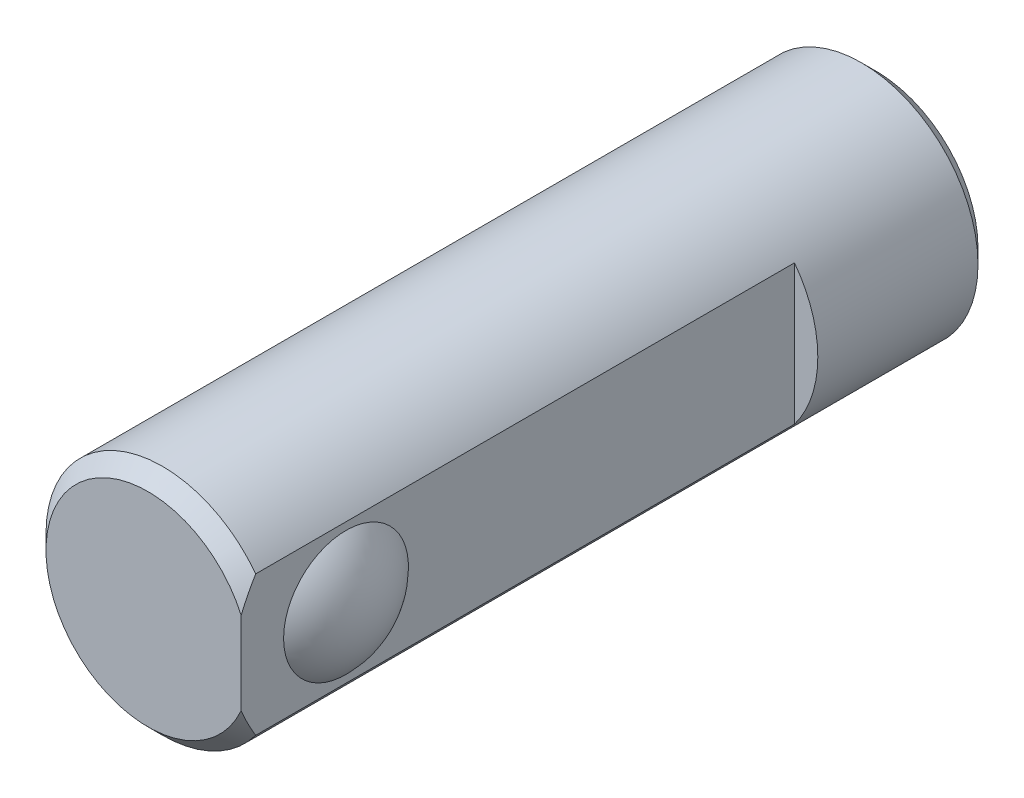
ISO-10303-21;
HEADER;
FILE_DESCRIPTION(('STEP AP214'),'2;1');
FILE_NAME('part.step','',(''),(''),'','','');
FILE_SCHEMA(('AUTOMOTIVE_DESIGN { 1 0 10303 214 1 1 1 1 }'));
ENDSEC;
DATA;
#1=APPLICATION_CONTEXT('core data for automotive mechanical design processes');
#2=APPLICATION_PROTOCOL_DEFINITION('international standard','automotive_design',2000,#1);
#3=PRODUCT_CONTEXT('',#1,'mechanical');
#4=PRODUCT('Part','Part','',(#3));
#5=PRODUCT_RELATED_PRODUCT_CATEGORY('part','',(#4));
#6=PRODUCT_DEFINITION_FORMATION('','',#4);
#7=PRODUCT_DEFINITION_CONTEXT('part definition',#1,'design');
#8=PRODUCT_DEFINITION('design','',#6,#7);
#9=PRODUCT_DEFINITION_SHAPE('','',#8);
#10=(LENGTH_UNIT() NAMED_UNIT(*) SI_UNIT(.MILLI.,.METRE.));
#11=(NAMED_UNIT(*) PLANE_ANGLE_UNIT() SI_UNIT($,.RADIAN.));
#12=(NAMED_UNIT(*) SI_UNIT($,.STERADIAN.) SOLID_ANGLE_UNIT());
#13=UNCERTAINTY_MEASURE_WITH_UNIT(LENGTH_MEASURE(1.E-05),#10,'distance_accuracy_value','');
#14=(GEOMETRIC_REPRESENTATION_CONTEXT(3) GLOBAL_UNCERTAINTY_ASSIGNED_CONTEXT((#13)) GLOBAL_UNIT_ASSIGNED_CONTEXT((#10,
#11,#12)) REPRESENTATION_CONTEXT('',''));
#15=CARTESIAN_POINT('',(0.,0.,0.));
#16=DIRECTION('',(0.,0.,1.));
#17=DIRECTION('',(1.,0.,0.));
#18=AXIS2_PLACEMENT_3D('',#15,#16,#17);
#19=CARTESIAN_POINT('',(3.2,2.4,6.));
#20=DIRECTION('',(-1.,0.,0.));
#21=DIRECTION('',(0.,0.,1.));
#22=AXIS2_PLACEMENT_3D('',#19,#20,#21);
#23=PLANE('',#22);
#24=DIRECTION('',(0.,-1.,0.));
#25=VECTOR('',#24,1.);
#26=CARTESIAN_POINT('',(3.2,2.4,25.));
#27=LINE('',#26,#25);
#28=CARTESIAN_POINT('',(3.2,1.41774468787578,25.));
#29=VERTEX_POINT('',#28);
#30=CARTESIAN_POINT('',(3.2,-1.41774468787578,25.));
#31=VERTEX_POINT('',#30);
#32=EDGE_CURVE('E54',#29,#31,#27,.T.);
#33=ORIENTED_EDGE('',*,*,#32,.T.);
#34=CARTESIAN_POINT('',(3.2,-1.41774468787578,25.));
#35=CARTESIAN_POINT('',(3.2,-1.5030503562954,24.9654302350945));
#36=CARTESIAN_POINT('',(3.2,-1.58742955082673,24.9286585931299));
#37=CARTESIAN_POINT('',(3.2,-1.75432885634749,24.8514141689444));
#38=CARTESIAN_POINT('',(3.2,-1.83685155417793,24.8109469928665));
#39=CARTESIAN_POINT('',(3.2,-2.00025969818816,24.7269204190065));
#40=CARTESIAN_POINT('',(3.2,-2.08114565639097,24.6833620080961));
#41=CARTESIAN_POINT('',(3.2,-2.24157538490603,24.5935610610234));
#42=CARTESIAN_POINT('',(3.2,-2.3211169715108,24.5473146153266));
#43=CARTESIAN_POINT('',(3.2,-2.4,24.5));
#44=B_SPLINE_CURVE_WITH_KNOTS('',3,(#34,#35,#36,#37,#38,#39,#40,#41,#42,#43),.UNSPECIFIED.,.F.,
.F.,(4,2,2,2,4),(0.,0.276056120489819,0.551700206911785,0.827256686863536,1.1032244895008),.UNSPECIFIED.);
#45=CARTESIAN_POINT('',(3.2,-2.4,24.5));
#46=VERTEX_POINT('',#45);
#47=EDGE_CURVE('E37',#31,#46,#44,.T.);
#48=ORIENTED_EDGE('',*,*,#47,.T.);
#49=DIRECTION('',(0.,0.,1.));
#50=VECTOR('',#49,1.);
#51=CARTESIAN_POINT('',(3.2,-2.4,6.));
#52=LINE('',#51,#50);
#53=CARTESIAN_POINT('',(3.2,-2.4,6.));
#54=VERTEX_POINT('',#53);
#55=EDGE_CURVE('E59',#54,#46,#52,.T.);
#56=ORIENTED_EDGE('',*,*,#55,.F.);
#57=DIRECTION('',(0.,-1.,0.));
#58=VECTOR('',#57,1.);
#59=CARTESIAN_POINT('',(3.2,2.4,6.));
#60=LINE('',#59,#58);
#61=CARTESIAN_POINT('',(3.2,2.4,6.));
#62=VERTEX_POINT('',#61);
#63=EDGE_CURVE('E53',#62,#54,#60,.T.);
#64=ORIENTED_EDGE('',*,*,#63,.F.);
#65=DIRECTION('',(0.,0.,1.));
#66=VECTOR('',#65,1.);
#67=CARTESIAN_POINT('',(3.2,2.4,6.));
#68=LINE('',#67,#66);
#69=CARTESIAN_POINT('',(3.2,2.4,24.5));
#70=VERTEX_POINT('',#69);
#71=EDGE_CURVE('E57',#62,#70,#68,.T.);
#72=ORIENTED_EDGE('',*,*,#71,.T.);
#73=CARTESIAN_POINT('',(3.2,2.4,24.5));
#74=CARTESIAN_POINT('',(3.2,2.3211169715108,24.5473146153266));
#75=CARTESIAN_POINT('',(3.2,2.24157538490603,24.5935610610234));
#76=CARTESIAN_POINT('',(3.2,2.08114565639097,24.6833620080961));
#77=CARTESIAN_POINT('',(3.2,2.00025969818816,24.7269204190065));
#78=CARTESIAN_POINT('',(3.2,1.83685155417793,24.8109469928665));
#79=CARTESIAN_POINT('',(3.2,1.75432885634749,24.8514141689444));
#80=CARTESIAN_POINT('',(3.2,1.58742955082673,24.9286585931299));
#81=CARTESIAN_POINT('',(3.2,1.5030503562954,24.9654302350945));
#82=CARTESIAN_POINT('',(3.2,1.41774468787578,25.));
#83=B_SPLINE_CURVE_WITH_KNOTS('',3,(#73,#74,#75,#76,#77,#78,#79,#80,#81,#82),.UNSPECIFIED.,.F.,
.F.,(4,2,2,2,4),(0.,0.275967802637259,0.551524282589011,0.827168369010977,1.1032244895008),.UNSPECIFIED.);
#84=EDGE_CURVE('E67',#70,#29,#83,.T.);
#85=ORIENTED_EDGE('',*,*,#84,.T.);
#86=EDGE_LOOP('',(#33,#48,#56,#64,#72,#85));
#87=FACE_BOUND('',#86,.T.);
#88=CARTESIAN_POINT('',(3.2,0.,21.4));
#89=DIRECTION('',(-1.,0.,0.));
#90=DIRECTION('',(0.,0.,1.));
#91=AXIS2_PLACEMENT_3D('',#88,#89,#90);
#92=CIRCLE('',#91,2.14242852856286);
#93=CARTESIAN_POINT('',(3.2,0.,23.5424285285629));
#94=VERTEX_POINT('',#93);
#95=EDGE_CURVE('E9',#94,#94,#92,.F.);
#96=ORIENTED_EDGE('',*,*,#95,.F.);
#97=EDGE_LOOP('',(#96));
#98=FACE_BOUND('',#97,.T.);
#99=ADVANCED_FACE('F14',(#87,#98),#23,.F.);
#100=CARTESIAN_POINT('',(0.,0.,0.));
#101=DIRECTION('',(0.,0.,1.));
#102=DIRECTION('',(1.,0.,0.));
#103=AXIS2_PLACEMENT_3D('',#100,#101,#102);
#104=CYLINDRICAL_SURFACE('',#103,4.);
#105=CARTESIAN_POINT('',(0.,0.,0.5));
#106=DIRECTION('',(0.,0.,1.));
#107=DIRECTION('',(1.,0.,0.));
#108=AXIS2_PLACEMENT_3D('',#105,#106,#107);
#109=CIRCLE('',#108,4.);
#110=CARTESIAN_POINT('',(4.,0.,0.5));
#111=VERTEX_POINT('',#110);
#112=EDGE_CURVE('E102',#111,#111,#109,.T.);
#113=ORIENTED_EDGE('',*,*,#112,.T.);
#114=EDGE_LOOP('',(#113));
#115=FACE_BOUND('',#114,.T.);
#116=ORIENTED_EDGE('',*,*,#55,.T.);
#117=CARTESIAN_POINT('',(0.,0.,24.5));
#118=DIRECTION('',(0.,0.,1.));
#119=DIRECTION('',(1.,0.,0.));
#120=AXIS2_PLACEMENT_3D('',#117,#118,#119);
#121=CIRCLE('',#120,4.);
#122=EDGE_CURVE('E29',#46,#70,#121,.F.);
#123=ORIENTED_EDGE('',*,*,#122,.T.);
#124=ORIENTED_EDGE('',*,*,#71,.F.);
#125=CARTESIAN_POINT('',(0.,0.,6.));
#126=DIRECTION('',(0.,0.,1.));
#127=DIRECTION('',(1.,0.,0.));
#128=AXIS2_PLACEMENT_3D('',#125,#126,#127);
#129=CIRCLE('',#128,4.);
#130=EDGE_CURVE('E50',#54,#62,#129,.T.);
#131=ORIENTED_EDGE('',*,*,#130,.F.);
#132=EDGE_LOOP('',(#116,#123,#124,#131));
#133=FACE_BOUND('',#132,.T.);
#134=ADVANCED_FACE('F16',(#115,#133),#104,.T.);
#135=CARTESIAN_POINT('',(0.,0.,0.));
#136=DIRECTION('',(0.,0.,1.));
#137=DIRECTION('',(1.,0.,0.));
#138=AXIS2_PLACEMENT_3D('',#135,#136,#137);
#139=PLANE('',#138);
#140=CARTESIAN_POINT('',(0.,0.,0.));
#141=DIRECTION('',(0.,0.,1.));
#142=DIRECTION('',(1.,0.,0.));
#143=AXIS2_PLACEMENT_3D('',#140,#141,#142);
#144=CIRCLE('',#143,3.5);
#145=CARTESIAN_POINT('',(3.5,0.,0.));
#146=VERTEX_POINT('',#145);
#147=EDGE_CURVE('E22',#146,#146,#144,.F.);
#148=ORIENTED_EDGE('',*,*,#147,.T.);
#149=EDGE_LOOP('',(#148));
#150=FACE_BOUND('',#149,.T.);
#151=ADVANCED_FACE('F90',(#150),#139,.F.);
#152=CARTESIAN_POINT('',(0.,0.,25.));
#153=DIRECTION('',(0.,0.,1.));
#154=DIRECTION('',(1.,0.,0.));
#155=AXIS2_PLACEMENT_3D('',#152,#153,#154);
#156=PLANE('',#155);
#157=ORIENTED_EDGE('',*,*,#32,.F.);
#158=CARTESIAN_POINT('',(0.,0.,25.));
#159=DIRECTION('',(0.,0.,1.));
#160=DIRECTION('',(1.,0.,0.));
#161=AXIS2_PLACEMENT_3D('',#158,#159,#160);
#162=CIRCLE('',#161,3.5);
#163=EDGE_CURVE('E62',#29,#31,#162,.T.);
#164=ORIENTED_EDGE('',*,*,#163,.T.);
#165=EDGE_LOOP('',(#157,#164));
#166=FACE_BOUND('',#165,.T.);
#167=ADVANCED_FACE('F87',(#166),#156,.T.);
#168=CARTESIAN_POINT('',(0.,0.,6.));
#169=DIRECTION('',(0.,0.,1.));
#170=DIRECTION('',(1.,0.,0.));
#171=AXIS2_PLACEMENT_3D('',#168,#169,#170);
#172=PLANE('',#171);
#173=ORIENTED_EDGE('',*,*,#130,.T.);
#174=ORIENTED_EDGE('',*,*,#63,.T.);
#175=EDGE_LOOP('',(#173,#174));
#176=FACE_BOUND('',#175,.T.);
#177=ADVANCED_FACE('F52',(#176),#172,.T.);
#178=CARTESIAN_POINT('',(0.,0.,25.));
#179=DIRECTION('',(0.,0.,-1.));
#180=DIRECTION('',(-1.,0.,0.));
#181=AXIS2_PLACEMENT_3D('',#178,#179,#180);
#182=CONICAL_SURFACE('',#181,3.5,0.785398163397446);
#183=ORIENTED_EDGE('',*,*,#84,.F.);
#184=ORIENTED_EDGE('',*,*,#122,.F.);
#185=ORIENTED_EDGE('',*,*,#47,.F.);
#186=ORIENTED_EDGE('',*,*,#163,.F.);
#187=EDGE_LOOP('',(#183,#184,#185,#186));
#188=FACE_BOUND('',#187,.T.);
#189=ADVANCED_FACE('F80',(#188),#182,.T.);
#190=CARTESIAN_POINT('',(0.,0.,0.5));
#191=DIRECTION('',(0.,0.,1.));
#192=DIRECTION('',(1.,0.,0.));
#193=AXIS2_PLACEMENT_3D('',#190,#191,#192);
#194=CONICAL_SURFACE('',#193,4.,0.785398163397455);
#195=ORIENTED_EDGE('',*,*,#147,.F.);
#196=EDGE_LOOP('',(#195));
#197=FACE_BOUND('',#196,.T.);
#198=ORIENTED_EDGE('',*,*,#112,.F.);
#199=EDGE_LOOP('',(#198));
#200=FACE_BOUND('',#199,.T.);
#201=ADVANCED_FACE('F107',(#197,#200),#194,.T.);
#202=CARTESIAN_POINT('',(1.09999999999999,0.,21.4));
#203=DIRECTION('',(0.,0.,-1.));
#204=DIRECTION('',(0.,1.,0.));
#205=AXIS2_PLACEMENT_3D('',#202,#203,#204);
#206=SPHERICAL_SURFACE('',#205,3.);
#207=CARTESIAN_POINT('',(1.09999999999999,0.,21.4));
#208=DIRECTION('',(-1.,0.,0.));
#209=DIRECTION('',(0.,0.,1.));
#210=AXIS2_PLACEMENT_3D('',#207,#208,#209);
#211=SPHERICAL_SURFACE('',#210,3.);
#212=ORIENTED_EDGE('',*,*,#95,.T.);
#213=EDGE_LOOP('',(#212));
#214=FACE_BOUND('',#213,.T.);
#215=ADVANCED_FACE('F109',(#214),#211,.T.);
#216=CLOSED_SHELL('',(#99,#134,#151,#167,#177,#189,#201,#215));
#217=MANIFOLD_SOLID_BREP('B1',#216);
#218=ADVANCED_BREP_SHAPE_REPRESENTATION('',(#18,#217),#14);
#219=SHAPE_DEFINITION_REPRESENTATION(#9,#218);
ENDSEC;
END-ISO-10303-21;
